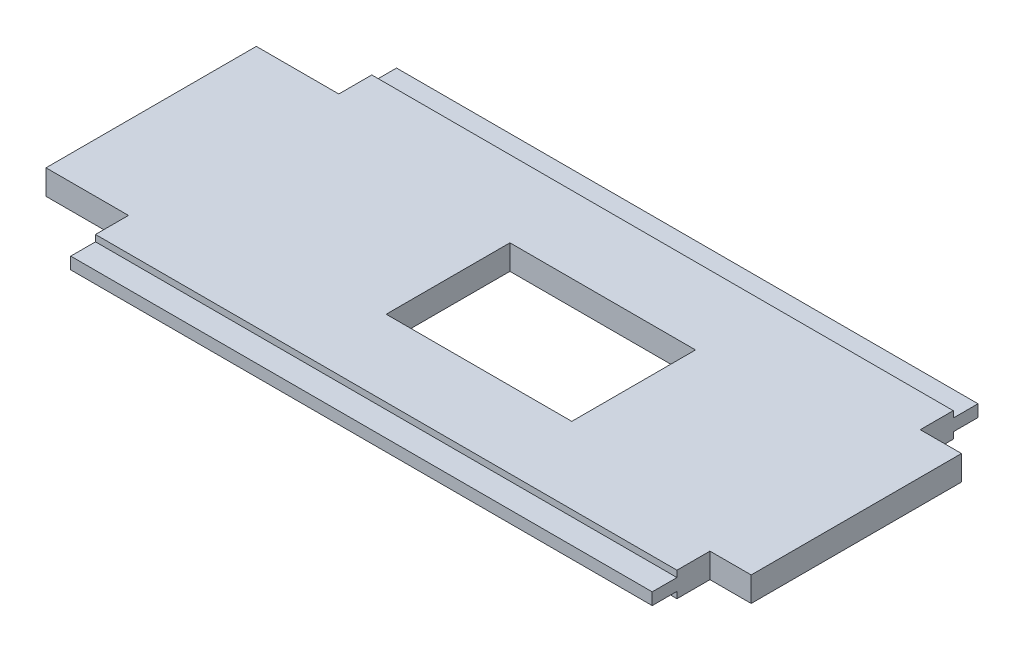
from build123d import *

# Parameters (mm, degrees)
CROQUIS1_W              = 141
CROQUIS1_H              = 67
CROQUIS1_W_2            = 45
CROQUIS1_H_2            = 30
SALIENTE_EXTRUIR1_DEPTH = 3
CROQUIS2_W              = 141
CROQUIS2_H              = 6
SALIENTE_EXTRUIR2_DEPTH = 1.45
CROQUIS4_W              = 51
CROQUIS4_H              = 6
SALIENTE_EXTRUIR3_DEPTH = 20
SALIENTE_EXTRUIR4_START = 141
CROQUIS4_2_W            = 51
CROQUIS4_2_H            = 6
SALIENTE_EXTRUIR4_DEPTH = 10


with BuildPart() as part:
    # Croquis1 → Saliente-Extruir1 (new, symmetric)
    with BuildSketch(Plane(origin=(0, 0, 0), x_dir=(1, 0, 0), z_dir=(0, 1, 0))):
        with Locations((70.5, 33.5)):
            Rectangle(CROQUIS1_W, CROQUIS1_H)
        with Locations((74.5, 33.5)):
            Rectangle(CROQUIS1_W_2, CROQUIS1_H_2, mode=Mode.SUBTRACT)
    extrude(amount=SALIENTE_EXTRUIR1_DEPTH, both=True)

    # Croquis2 → Saliente-Extruir2 (add, symmetric)
    with BuildSketch(Plane(origin=(0, 0, 0), x_dir=(1, 0, 0), z_dir=(0, 1, 0))):
        with Locations((70.5, -3)):
            Rectangle(CROQUIS2_W, CROQUIS2_H)
        with Locations((70.5, 70)):
            Rectangle(CROQUIS2_W, CROQUIS2_H)
    extrude(amount=SALIENTE_EXTRUIR2_DEPTH, both=True)

    # Croquis4 → Saliente-Extruir3 (add)
    with BuildSketch(Plane(origin=(0, 0, 0), x_dir=(0, 0, -1), z_dir=(1, 0, 0))):
        with Locations((33.5, 0)):
            Rectangle(CROQUIS4_W, CROQUIS4_H)
    extrude(amount=-SALIENTE_EXTRUIR3_DEPTH)

    # Croquis4_2 → Saliente-Extruir4 (add)
    with BuildSketch(Plane(origin=(0, 0, 0), x_dir=(0, 0, -1), z_dir=(1, 0, 0)).offset(SALIENTE_EXTRUIR4_START)):
        with Locations((33.5, 0)):
            Rectangle(CROQUIS4_2_W, CROQUIS4_2_H)
    extrude(amount=SALIENTE_EXTRUIR4_DEPTH)


solid = part.part
